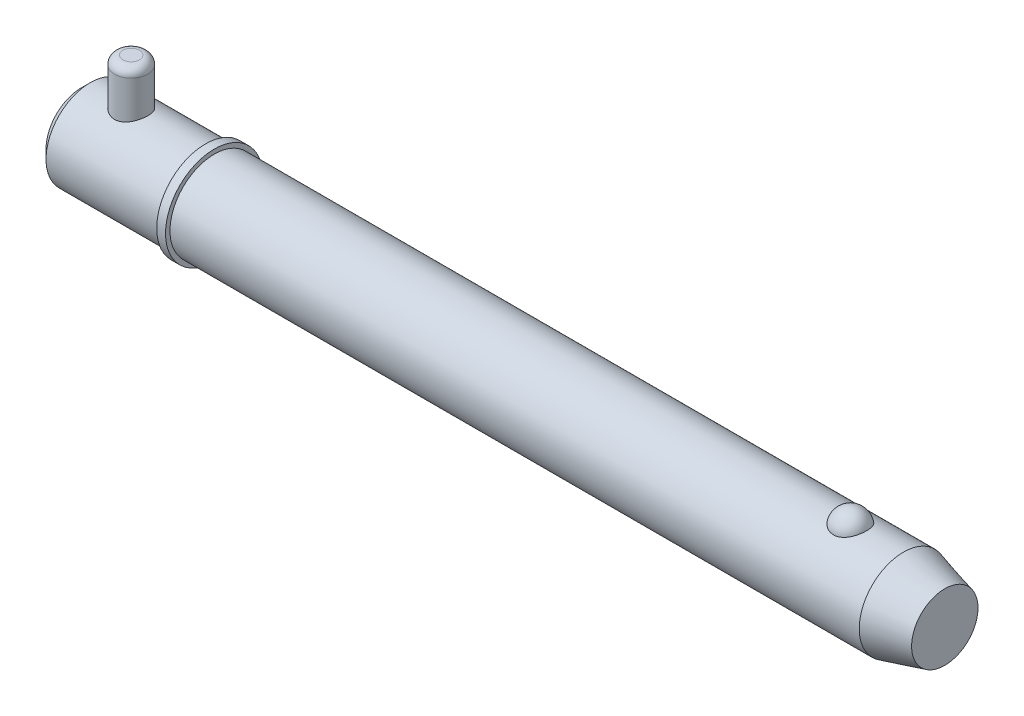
ISO-10303-21;
HEADER;
FILE_DESCRIPTION(('STEP AP214'),'2;1');
FILE_NAME('part.step','',(''),(''),'','','');
FILE_SCHEMA(('AUTOMOTIVE_DESIGN { 1 0 10303 214 1 1 1 1 }'));
ENDSEC;
DATA;
#1=APPLICATION_CONTEXT('core data for automotive mechanical design processes');
#2=APPLICATION_PROTOCOL_DEFINITION('international standard','automotive_design',2000,#1);
#3=PRODUCT_CONTEXT('',#1,'mechanical');
#4=PRODUCT('Part','Part','',(#3));
#5=PRODUCT_RELATED_PRODUCT_CATEGORY('part','',(#4));
#6=PRODUCT_DEFINITION_FORMATION('','',#4);
#7=PRODUCT_DEFINITION_CONTEXT('part definition',#1,'design');
#8=PRODUCT_DEFINITION('design','',#6,#7);
#9=PRODUCT_DEFINITION_SHAPE('','',#8);
#10=(LENGTH_UNIT() NAMED_UNIT(*) SI_UNIT(.MILLI.,.METRE.));
#11=(NAMED_UNIT(*) PLANE_ANGLE_UNIT() SI_UNIT($,.RADIAN.));
#12=(NAMED_UNIT(*) SI_UNIT($,.STERADIAN.) SOLID_ANGLE_UNIT());
#13=UNCERTAINTY_MEASURE_WITH_UNIT(LENGTH_MEASURE(1.E-05),#10,'distance_accuracy_value','');
#14=(GEOMETRIC_REPRESENTATION_CONTEXT(3) GLOBAL_UNCERTAINTY_ASSIGNED_CONTEXT((#13)) GLOBAL_UNIT_ASSIGNED_CONTEXT((#10,
#11,#12)) REPRESENTATION_CONTEXT('',''));
#15=CARTESIAN_POINT('',(0.,0.,0.));
#16=DIRECTION('',(0.,0.,1.));
#17=DIRECTION('',(1.,0.,0.));
#18=AXIS2_PLACEMENT_3D('',#15,#16,#17);
#19=CARTESIAN_POINT('',(14.28,25.4,0.));
#20=DIRECTION('',(0.,-1.,0.));
#21=DIRECTION('',(0.,0.,-1.));
#22=AXIS2_PLACEMENT_3D('',#19,#20,#21);
#23=CYLINDRICAL_SURFACE('',#22,4.76);
#24=CARTESIAN_POINT('',(14.28,-10.32,0.));
#25=DIRECTION('',(0.,1.,0.));
#26=DIRECTION('',(0.,0.,1.));
#27=AXIS2_PLACEMENT_3D('',#24,#25,#26);
#28=CIRCLE('',#27,4.76);
#29=CARTESIAN_POINT('',(14.28,-10.32,-4.76));
#30=VERTEX_POINT('',#29);
#31=EDGE_CURVE('P0_E25',#30,#30,#28,.T.);
#32=CARTESIAN_POINT('',(14.28,23.02,0.));
#33=DIRECTION('',(0.,1.,0.));
#34=DIRECTION('',(0.,0.,1.));
#35=AXIS2_PLACEMENT_3D('',#32,#33,#34);
#36=CIRCLE('',#35,4.76);
#37=CARTESIAN_POINT('',(14.28,23.02,-4.76));
#38=VERTEX_POINT('',#37);
#39=EDGE_CURVE('P0_E29',#38,#38,#36,.F.);
#40=CARTESIAN_POINT('',(14.28,-10.32,-4.76));
#41=CARTESIAN_POINT('',(14.28,-9.97270833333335,-4.76));
#42=CARTESIAN_POINT('',(14.28,-9.62541666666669,-4.76));
#43=CARTESIAN_POINT('',(14.28,-8.93083333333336,-4.76));
#44=CARTESIAN_POINT('',(14.28,-8.58354166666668,-4.76));
#45=CARTESIAN_POINT('',(14.28,-7.88895833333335,-4.76));
#46=CARTESIAN_POINT('',(14.28,-7.54166666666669,-4.76));
#47=CARTESIAN_POINT('',(14.28,-6.84708333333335,-4.76));
#48=CARTESIAN_POINT('',(14.28,-6.49979166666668,-4.76));
#49=CARTESIAN_POINT('',(14.28,-5.80520833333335,-4.76));
#50=CARTESIAN_POINT('',(14.28,-5.45791666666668,-4.76));
#51=CARTESIAN_POINT('',(14.28,-4.76333333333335,-4.76));
#52=CARTESIAN_POINT('',(14.28,-4.41604166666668,-4.76));
#53=CARTESIAN_POINT('',(14.28,-3.72145833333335,-4.76));
#54=CARTESIAN_POINT('',(14.28,-3.37416666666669,-4.76));
#55=CARTESIAN_POINT('',(14.28,-2.67958333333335,-4.76));
#56=CARTESIAN_POINT('',(14.28,-2.33229166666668,-4.76));
#57=CARTESIAN_POINT('',(14.28,-1.63770833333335,-4.76));
#58=CARTESIAN_POINT('',(14.28,-1.29041666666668,-4.76));
#59=CARTESIAN_POINT('',(14.28,-0.595833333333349,-4.76));
#60=CARTESIAN_POINT('',(14.28,-0.24854166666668,-4.76));
#61=CARTESIAN_POINT('',(14.28,0.446041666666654,-4.76));
#62=CARTESIAN_POINT('',(14.28,0.793333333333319,-4.76));
#63=CARTESIAN_POINT('',(14.28,1.48791666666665,-4.76));
#64=CARTESIAN_POINT('',(14.28,1.83520833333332,-4.76));
#65=CARTESIAN_POINT('',(14.28,2.52979166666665,-4.76));
#66=CARTESIAN_POINT('',(14.28,2.87708333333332,-4.76));
#67=CARTESIAN_POINT('',(14.28,3.57166666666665,-4.76));
#68=CARTESIAN_POINT('',(14.28,3.91895833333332,-4.76));
#69=CARTESIAN_POINT('',(14.28,4.61354166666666,-4.76));
#70=CARTESIAN_POINT('',(14.28,4.96083333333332,-4.76));
#71=CARTESIAN_POINT('',(14.28,5.65541666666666,-4.76));
#72=CARTESIAN_POINT('',(14.28,6.00270833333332,-4.76));
#73=CARTESIAN_POINT('',(14.28,6.69729166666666,-4.76));
#74=CARTESIAN_POINT('',(14.28,7.04458333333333,-4.76));
#75=CARTESIAN_POINT('',(14.28,7.73916666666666,-4.76));
#76=CARTESIAN_POINT('',(14.28,8.08645833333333,-4.76));
#77=CARTESIAN_POINT('',(14.28,8.78104166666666,-4.76));
#78=CARTESIAN_POINT('',(14.28,9.12833333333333,-4.76));
#79=CARTESIAN_POINT('',(14.28,9.82291666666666,-4.76));
#80=CARTESIAN_POINT('',(14.28,10.1702083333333,-4.76));
#81=CARTESIAN_POINT('',(14.28,10.8647916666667,-4.76));
#82=CARTESIAN_POINT('',(14.28,11.2120833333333,-4.76));
#83=CARTESIAN_POINT('',(14.28,11.9066666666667,-4.76));
#84=CARTESIAN_POINT('',(14.28,12.2539583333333,-4.76));
#85=CARTESIAN_POINT('',(14.28,12.9485416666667,-4.76));
#86=CARTESIAN_POINT('',(14.28,13.2958333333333,-4.76));
#87=CARTESIAN_POINT('',(14.28,13.9904166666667,-4.76));
#88=CARTESIAN_POINT('',(14.28,14.3377083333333,-4.76));
#89=CARTESIAN_POINT('',(14.28,15.0322916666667,-4.76));
#90=CARTESIAN_POINT('',(14.28,15.3795833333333,-4.76));
#91=CARTESIAN_POINT('',(14.28,16.0741666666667,-4.76));
#92=CARTESIAN_POINT('',(14.28,16.4214583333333,-4.76));
#93=CARTESIAN_POINT('',(14.28,17.1160416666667,-4.76));
#94=CARTESIAN_POINT('',(14.28,17.4633333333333,-4.76));
#95=CARTESIAN_POINT('',(14.28,18.1579166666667,-4.76));
#96=CARTESIAN_POINT('',(14.28,18.5052083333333,-4.76));
#97=CARTESIAN_POINT('',(14.28,19.1997916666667,-4.76));
#98=CARTESIAN_POINT('',(14.28,19.5470833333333,-4.76));
#99=CARTESIAN_POINT('',(14.28,20.2416666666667,-4.76));
#100=CARTESIAN_POINT('',(14.28,20.5889583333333,-4.76));
#101=CARTESIAN_POINT('',(14.28,21.2835416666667,-4.76));
#102=CARTESIAN_POINT('',(14.28,21.6308333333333,-4.76));
#103=CARTESIAN_POINT('',(14.28,22.3254166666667,-4.76));
#104=CARTESIAN_POINT('',(14.28,22.6727083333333,-4.76));
#105=CARTESIAN_POINT('',(14.28,23.02,-4.76));
#106=B_SPLINE_CURVE_WITH_KNOTS('',3,(#40,#41,#42,#43,#44,#45,#46,#47,#48,#49,#50,#51,#52,#53,
#54,#55,#56,#57,#58,#59,#60,#61,#62,#63,#64,#65,#66,#67,#68,#69,#70,#71,#72,#73,#74,#75,#76,#77,
#78,#79,#80,#81,#82,#83,#84,#85,#86,#87,#88,#89,#90,#91,#92,#93,#94,#95,#96,#97,#98,#99,#100,
#101,#102,#103,#104,#105),.UNSPECIFIED.,.F.,.F.,(4,2,2,2,2,2,2,2,2,2,2,2,2,2,2,2,2,2,2,2,2,2,2,
2,2,2,2,2,2,2,2,2,4),(0.,1.041875,2.08375,3.125625,4.1675,5.209375,6.25125,7.293125,
8.33500000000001,9.376875,10.41875,11.460625,12.5025,13.544375,14.58625,15.628125,16.67,
17.711875,18.75375,19.795625,20.8375,21.879375,22.92125,23.963125,25.005,26.046875,27.08875,
28.130625,29.1725,30.214375,31.25625,32.298125,33.34),.UNSPECIFIED.);
#107=EDGE_CURVE('P0_BSEAM14',#30,#38,#106,.T.);
#108=ORIENTED_EDGE('',*,*,#31,.T.);
#109=ORIENTED_EDGE('',*,*,#39,.T.);
#110=ORIENTED_EDGE('',*,*,#107,.T.);
#111=ORIENTED_EDGE('',*,*,#107,.F.);
#112=EDGE_LOOP('',(#108,#110,#109,#111));
#113=FACE_BOUND('',#112,.T.);
#114=ADVANCED_FACE('P0_F14',(#113),#23,.T.);
#115=CARTESIAN_POINT('',(14.28,25.4,0.));
#116=DIRECTION('',(0.,1.,0.));
#117=DIRECTION('',(0.,0.,1.));
#118=AXIS2_PLACEMENT_3D('',#115,#116,#117);
#119=PLANE('',#118);
#120=CARTESIAN_POINT('',(14.28,25.4,0.));
#121=DIRECTION('',(0.,1.,0.));
#122=DIRECTION('',(0.,0.,1.));
#123=AXIS2_PLACEMENT_3D('',#120,#121,#122);
#124=CIRCLE('',#123,2.38);
#125=CARTESIAN_POINT('',(14.28,25.4,2.38));
#126=VERTEX_POINT('',#125);
#127=EDGE_CURVE('P0_E10',#126,#126,#124,.T.);
#128=ORIENTED_EDGE('',*,*,#127,.T.);
#129=EDGE_LOOP('',(#128));
#130=FACE_BOUND('',#129,.T.);
#131=ADVANCED_FACE('P0_F46',(#130),#119,.T.);
#132=CARTESIAN_POINT('',(14.28,-12.7,0.));
#133=DIRECTION('',(0.,1.,0.));
#134=DIRECTION('',(0.,0.,1.));
#135=AXIS2_PLACEMENT_3D('',#132,#133,#134);
#136=PLANE('',#135);
#137=CARTESIAN_POINT('',(14.28,-12.7,0.));
#138=DIRECTION('',(0.,1.,0.));
#139=DIRECTION('',(0.,0.,1.));
#140=AXIS2_PLACEMENT_3D('',#137,#138,#139);
#141=CIRCLE('',#140,2.38);
#142=CARTESIAN_POINT('',(14.28,-12.7,2.38));
#143=VERTEX_POINT('',#142);
#144=EDGE_CURVE('P0_E21',#143,#143,#141,.F.);
#145=ORIENTED_EDGE('',*,*,#144,.T.);
#146=EDGE_LOOP('',(#145));
#147=FACE_BOUND('',#146,.T.);
#148=ADVANCED_FACE('P0_F43',(#147),#136,.F.);
#149=CARTESIAN_POINT('',(14.28,-10.32,0.));
#150=DIRECTION('',(0.,1.,0.));
#151=DIRECTION('',(0.,0.,1.));
#152=AXIS2_PLACEMENT_3D('',#149,#150,#151);
#153=DEGENERATE_TOROIDAL_SURFACE('',#152,2.38,2.38,.T.);
#154=ORIENTED_EDGE('',*,*,#144,.F.);
#155=EDGE_LOOP('',(#154));
#156=FACE_BOUND('',#155,.T.);
#157=ORIENTED_EDGE('',*,*,#31,.F.);
#158=EDGE_LOOP('',(#157));
#159=FACE_BOUND('',#158,.T.);
#160=ADVANCED_FACE('P0_F38',(#156,#159),#153,.T.);
#161=CARTESIAN_POINT('',(14.28,23.02,0.));
#162=DIRECTION('',(0.,1.,0.));
#163=DIRECTION('',(0.,0.,1.));
#164=AXIS2_PLACEMENT_3D('',#161,#162,#163);
#165=DEGENERATE_TOROIDAL_SURFACE('',#164,2.38,2.38,.T.);
#166=ORIENTED_EDGE('',*,*,#39,.F.);
#167=EDGE_LOOP('',(#166));
#168=FACE_BOUND('',#167,.T.);
#169=ORIENTED_EDGE('',*,*,#127,.F.);
#170=EDGE_LOOP('',(#169));
#171=FACE_BOUND('',#170,.T.);
#172=ADVANCED_FACE('P0_F16',(#168,#171),#165,.T.);
#173=CLOSED_SHELL('',(#114,#131,#148,#160,#172));
#174=MANIFOLD_SOLID_BREP('P0_B1',#173);
#175=CARTESIAN_POINT('',(0.,0.,0.));
#176=DIRECTION('',(1.,0.,0.));
#177=DIRECTION('',(0.,0.,-1.));
#178=AXIS2_PLACEMENT_3D('',#175,#176,#177);
#179=CYLINDRICAL_SURFACE('',#178,12.7);
#180=CARTESIAN_POINT('',(235.800738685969,0.,0.));
#181=DIRECTION('',(1.,0.,0.));
#182=DIRECTION('',(0.,0.,-1.));
#183=AXIS2_PLACEMENT_3D('',#180,#181,#182);
#184=CIRCLE('',#183,12.7);
#185=CARTESIAN_POINT('',(235.800738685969,0.,-12.7));
#186=VERTEX_POINT('',#185);
#187=EDGE_CURVE('P1_E81',#186,#186,#184,.T.);
#188=ORIENTED_EDGE('',*,*,#187,.F.);
#189=EDGE_LOOP('',(#188));
#190=FACE_BOUND('',#189,.T.);
#191=CARTESIAN_POINT('',(38.1,0.,0.));
#192=DIRECTION('',(1.,0.,0.));
#193=DIRECTION('',(0.,0.,-1.));
#194=AXIS2_PLACEMENT_3D('',#191,#192,#193);
#195=CIRCLE('',#194,12.7);
#196=CARTESIAN_POINT('',(38.1,0.,-12.7));
#197=VERTEX_POINT('',#196);
#198=EDGE_CURVE('P1_E85',#197,#197,#195,.T.);
#199=ORIENTED_EDGE('',*,*,#198,.T.);
#200=EDGE_LOOP('',(#199));
#201=FACE_BOUND('',#200,.T.);
#202=CARTESIAN_POINT('',(220.560042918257,11.7500437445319,4.81938502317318));
#203=CARTESIAN_POINT('',(220.435088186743,11.7500430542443,4.81938571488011));
#204=CARTESIAN_POINT('',(220.310144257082,11.7520975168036,4.81438658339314));
#205=CARTESIAN_POINT('',(220.061142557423,11.760253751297,4.79442904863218));
#206=CARTESIAN_POINT('',(219.937085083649,11.7663568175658,4.77946746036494));
#207=CARTESIAN_POINT('',(219.690901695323,11.7824262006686,4.73971414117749));
#208=CARTESIAN_POINT('',(219.568774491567,11.7923898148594,4.71492928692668));
#209=CARTESIAN_POINT('',(219.327187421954,11.8158938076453,4.65571340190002));
#210=CARTESIAN_POINT('',(219.20772859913,11.8294355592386,4.6212786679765));
#211=CARTESIAN_POINT('',(218.972557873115,11.8596812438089,4.54309502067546));
#212=CARTESIAN_POINT('',(218.856839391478,11.8763792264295,4.49936361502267));
#213=CARTESIAN_POINT('',(218.629653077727,11.9124878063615,4.40287235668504));
#214=CARTESIAN_POINT('',(218.518186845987,11.9318994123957,4.35010914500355));
#215=CARTESIAN_POINT('',(218.191278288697,11.9934256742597,4.17881316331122));
#216=CARTESIAN_POINT('',(217.983127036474,12.038858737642,4.04720756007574));
#217=CARTESIAN_POINT('',(217.585850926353,12.1352173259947,3.748564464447));
#218=CARTESIAN_POINT('',(217.397443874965,12.1862630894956,3.58061821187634));
#219=CARTESIAN_POINT('',(217.050521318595,12.2875163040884,3.21600758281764));
#220=CARTESIAN_POINT('',(216.892011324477,12.3377235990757,3.0193379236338));
#221=CARTESIAN_POINT('',(216.60168878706,12.4344923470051,2.592916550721));
#222=CARTESIAN_POINT('',(216.471376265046,12.4807925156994,2.36208286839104));
#223=CARTESIAN_POINT('',(216.249407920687,12.5623454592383,1.88070399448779));
#224=CARTESIAN_POINT('',(216.157755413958,12.5975972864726,1.63015711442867));
#225=CARTESIAN_POINT('',(216.014046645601,12.6538414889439,1.1129886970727));
#226=CARTESIAN_POINT('',(215.962499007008,12.6746503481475,0.846205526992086));
#227=CARTESIAN_POINT('',(215.901977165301,12.699153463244,0.307085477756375));
#228=CARTESIAN_POINT('',(215.893001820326,12.7028481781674,0.034748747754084));
#229=CARTESIAN_POINT('',(215.917731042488,12.6927785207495,-0.506073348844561));
#230=CARTESIAN_POINT('',(215.951189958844,12.6791146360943,-0.774571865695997));
#231=CARTESIAN_POINT('',(216.059687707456,12.635882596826,-1.30170246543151));
#232=CARTESIAN_POINT('',(216.13472729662,12.606314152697,-1.56033436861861));
#233=CARTESIAN_POINT('',(216.32500006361,12.5342328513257,-2.0608389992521));
#234=CARTESIAN_POINT('',(216.440287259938,12.4917026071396,-2.30268867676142));
#235=CARTESIAN_POINT('',(216.708704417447,12.3981123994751,-2.76259600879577));
#236=CARTESIAN_POINT('',(216.861837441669,12.3470517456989,-2.98065173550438));
#237=CARTESIAN_POINT('',(217.203507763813,12.2416045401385,-3.38786328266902));
#238=CARTESIAN_POINT('',(217.392201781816,12.1872040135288,-3.57688418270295));
#239=CARTESIAN_POINT('',(217.800239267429,12.0814086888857,-3.91941073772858));
#240=CARTESIAN_POINT('',(218.019580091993,12.0300136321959,-4.07291945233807));
#241=CARTESIAN_POINT('',(218.478375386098,11.9373542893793,-4.33691289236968));
#242=CARTESIAN_POINT('',(218.717304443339,11.8958982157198,-4.44824125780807));
#243=CARTESIAN_POINT('',(219.21243761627,11.8268116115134,-4.62881985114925));
#244=CARTESIAN_POINT('',(219.468635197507,11.7991758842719,-4.69808589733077));
#245=CARTESIAN_POINT('',(219.977164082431,11.7622209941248,-4.78983181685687));
#246=CARTESIAN_POINT('',(220.229041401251,11.7520502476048,-4.81449025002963));
#247=CARTESIAN_POINT('',(220.733573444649,11.7485796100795,-4.82295735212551));
#248=CARTESIAN_POINT('',(220.986228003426,11.7552763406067,-4.80677420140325));
#249=CARTESIAN_POINT('',(221.476834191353,11.7842584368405,-4.73525430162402));
#250=CARTESIAN_POINT('',(221.714998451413,11.8060486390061,-4.68116061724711));
#251=CARTESIAN_POINT('',(222.178489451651,11.8622750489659,-4.53678133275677));
#252=CARTESIAN_POINT('',(222.403815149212,11.8967122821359,-4.44649279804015));
#253=CARTESIAN_POINT('',(222.840801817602,11.9754603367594,-4.22987613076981));
#254=CARTESIAN_POINT('',(223.052057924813,12.0199699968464,-4.10280539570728));
#255=CARTESIAN_POINT('',(223.450601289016,12.1138028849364,-3.81685409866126));
#256=CARTESIAN_POINT('',(223.637883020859,12.163127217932,-3.65796622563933));
#257=CARTESIAN_POINT('',(223.993350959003,12.2642343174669,-3.30364864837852));
#258=CARTESIAN_POINT('',(224.160111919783,12.3160165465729,-3.10678783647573));
#259=CARTESIAN_POINT('',(224.459579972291,12.4142566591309,-2.68748409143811));
#260=CARTESIAN_POINT('',(224.592280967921,12.4607135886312,-2.4650365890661));
#261=CARTESIAN_POINT('',(224.824691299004,12.5450236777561,-1.9928951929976));
#262=CARTESIAN_POINT('',(224.923215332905,12.5825557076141,-1.74255918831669));
#263=CARTESIAN_POINT('',(225.079227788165,12.6431720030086,-1.22773734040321));
#264=CARTESIAN_POINT('',(225.136715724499,12.6662560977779,-0.963251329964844));
#265=CARTESIAN_POINT('',(225.209544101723,12.6956486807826,-0.427355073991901));
#266=CARTESIAN_POINT('',(225.224837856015,12.7019385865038,-0.155937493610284));
#267=CARTESIAN_POINT('',(225.212779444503,12.6970201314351,0.385928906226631));
#268=CARTESIAN_POINT('',(225.18542805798,12.6858120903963,0.656377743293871));
#269=CARTESIAN_POINT('',(225.113060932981,12.6568455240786,1.05454017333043));
#270=CARTESIAN_POINT('',(225.083796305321,12.6451962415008,1.185778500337));
#271=CARTESIAN_POINT('',(225.015022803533,12.6181819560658,1.44513808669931));
#272=CARTESIAN_POINT('',(224.975517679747,12.6028183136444,1.57326046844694));
#273=CARTESIAN_POINT('',(224.886439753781,12.5687547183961,1.82554978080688));
#274=CARTESIAN_POINT('',(224.836862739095,12.5500533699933,1.94971503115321));
#275=CARTESIAN_POINT('',(224.72792115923,12.5098093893,2.19314370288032));
#276=CARTESIAN_POINT('',(224.668560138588,12.4882677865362,2.31240887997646));
#277=CARTESIAN_POINT('',(224.53997128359,12.4427679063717,2.5459303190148));
#278=CARTESIAN_POINT('',(224.470688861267,12.4187964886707,2.66015396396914));
#279=CARTESIAN_POINT('',(224.322903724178,12.3691892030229,2.882026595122));
#280=CARTESIAN_POINT('',(224.244404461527,12.3435539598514,2.98967802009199));
#281=CARTESIAN_POINT('',(224.078550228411,12.2912955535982,3.1977438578));
#282=CARTESIAN_POINT('',(223.991191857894,12.2646720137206,3.298155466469));
#283=CARTESIAN_POINT('',(223.808161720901,12.2111945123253,3.49095035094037));
#284=CARTESIAN_POINT('',(223.712493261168,12.1843406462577,3.58333679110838));
#285=CARTESIAN_POINT('',(223.513627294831,12.1312249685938,3.75922876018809));
#286=CARTESIAN_POINT('',(223.410450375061,12.104961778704,3.84275713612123));
#287=CARTESIAN_POINT('',(223.19701336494,12.0537284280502,4.00056406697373));
#288=CARTESIAN_POINT('',(223.086756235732,12.028757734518,4.07484645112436));
#289=CARTESIAN_POINT('',(222.859755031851,11.9808306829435,4.21367959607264));
#290=CARTESIAN_POINT('',(222.743006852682,11.9578756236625,4.27822410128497));
#291=CARTESIAN_POINT('',(222.50394258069,11.9147184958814,4.39698483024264));
#292=CARTESIAN_POINT('',(222.381628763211,11.894515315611,4.45120522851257));
#293=CARTESIAN_POINT('',(222.122952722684,11.8561129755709,4.55255353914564));
#294=CARTESIAN_POINT('',(221.986223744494,11.8381764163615,4.59884858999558));
#295=CARTESIAN_POINT('',(221.708608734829,11.8069093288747,4.67853897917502));
#296=CARTESIAN_POINT('',(221.567724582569,11.7935767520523,4.71194005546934));
#297=CARTESIAN_POINT('',(221.28309446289,11.7720277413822,4.76552188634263));
#298=CARTESIAN_POINT('',(221.139348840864,11.7638106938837,4.78570422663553));
#299=CARTESIAN_POINT('',(220.850411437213,11.7528195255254,4.81263433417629));
#300=CARTESIAN_POINT('',(220.705219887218,11.7500445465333,4.81938421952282));
#301=CARTESIAN_POINT('',(220.560042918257,11.7500437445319,4.81938502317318));
#302=B_SPLINE_CURVE_WITH_KNOTS('',3,(#202,#203,#204,#205,#206,#207,#208,#209,#210,#211,#212,
#213,#214,#215,#216,#217,#218,#219,#220,#221,#222,#223,#224,#225,#226,#227,#228,#229,#230,#231,
#232,#233,#234,#235,#236,#237,#238,#239,#240,#241,#242,#243,#244,#245,#246,#247,#248,#249,#250,
#251,#252,#253,#254,#255,#256,#257,#258,#259,#260,#261,#262,#263,#264,#265,#266,#267,#268,#269,
#270,#271,#272,#273,#274,#275,#276,#277,#278,#279,#280,#281,#282,#283,#284,#285,#286,#287,#288,
#289,#290,#291,#292,#293,#294,#295,#296,#297,#298,#299,#300,#301),.UNSPECIFIED.,.T.,.F.,(4,2,2,
2,2,2,2,2,2,2,2,2,2,2,2,2,2,2,2,2,2,2,2,2,2,2,2,2,2,2,2,2,2,2,2,2,2,2,2,2,2,2,2,2,2,2,2,2,2,4),
(0.,0.374729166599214,0.749578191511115,1.12416526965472,1.49889629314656,1.87292776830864,
2.24709865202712,2.99481328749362,3.76399449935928,4.53331735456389,5.3368391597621,
6.14042986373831,6.95405296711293,7.76765424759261,8.57656703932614,9.38549455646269,
10.1955119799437,11.0055949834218,11.8193353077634,12.6330054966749,13.4294141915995,
14.2255231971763,14.9815786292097,15.7374826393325,16.4696948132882,17.2019663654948,
17.9501979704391,18.6986017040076,19.4844704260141,20.2704797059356,21.0815215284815,
21.8925729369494,22.7045213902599,23.5164550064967,23.9209608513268,24.3253187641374,
24.7298461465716,25.1342272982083,25.5409255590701,25.9474719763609,26.3541750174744,
26.7607169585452,27.1661834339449,27.5714814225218,27.9770386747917,28.3824315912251,
28.8181206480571,29.2536155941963,29.6890582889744,30.1244323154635),.UNSPECIFIED.);
#303=CARTESIAN_POINT('',(220.560042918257,11.7500437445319,4.81938502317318));
#304=VERTEX_POINT('',#303);
#305=EDGE_CURVE('P1_E35',#304,#304,#302,.T.);
#306=ORIENTED_EDGE('',*,*,#305,.T.);
#307=EDGE_LOOP('',(#306));
#308=FACE_BOUND('',#307,.T.);
#309=ADVANCED_FACE('P1_F13',(#190,#201,#308),#179,.T.);
#310=CARTESIAN_POINT('',(0.,0.,0.));
#311=DIRECTION('',(-1.,0.,0.));
#312=DIRECTION('',(0.,0.,1.));
#313=AXIS2_PLACEMENT_3D('',#310,#311,#312);
#314=PLANE('',#313);
#315=CARTESIAN_POINT('',(0.,0.,0.));
#316=DIRECTION('',(1.,0.,0.));
#317=DIRECTION('',(0.,0.,-1.));
#318=AXIS2_PLACEMENT_3D('',#315,#316,#317);
#319=CIRCLE('',#318,10.16);
#320=CARTESIAN_POINT('',(0.,0.,-10.16));
#321=VERTEX_POINT('',#320);
#322=EDGE_CURVE('P1_E9',#321,#321,#319,.T.);
#323=ORIENTED_EDGE('',*,*,#322,.F.);
#324=EDGE_LOOP('',(#323));
#325=FACE_BOUND('',#324,.T.);
#326=ADVANCED_FACE('P1_F15',(#325),#314,.T.);
#327=CARTESIAN_POINT('',(2.53999999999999,0.,0.));
#328=DIRECTION('',(1.,0.,0.));
#329=DIRECTION('',(0.,0.,-1.));
#330=AXIS2_PLACEMENT_3D('',#327,#328,#329);
#331=CONICAL_SURFACE('',#330,12.7,0.78539816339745);
#332=ORIENTED_EDGE('',*,*,#322,.T.);
#333=EDGE_LOOP('',(#332));
#334=FACE_BOUND('',#333,.T.);
#335=CARTESIAN_POINT('',(2.53999999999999,0.,0.));
#336=DIRECTION('',(1.,0.,0.));
#337=DIRECTION('',(0.,0.,-1.));
#338=AXIS2_PLACEMENT_3D('',#335,#336,#337);
#339=CIRCLE('',#338,12.7);
#340=CARTESIAN_POINT('',(2.53999999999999,0.,-12.7));
#341=VERTEX_POINT('',#340);
#342=EDGE_CURVE('P1_E26',#341,#341,#339,.T.);
#343=ORIENTED_EDGE('',*,*,#342,.F.);
#344=EDGE_LOOP('',(#343));
#345=FACE_BOUND('',#344,.T.);
#346=ADVANCED_FACE('P1_F77',(#334,#345),#331,.T.);
#347=CARTESIAN_POINT('',(0.,0.,0.));
#348=DIRECTION('',(1.,0.,0.));
#349=DIRECTION('',(0.,0.,-1.));
#350=AXIS2_PLACEMENT_3D('',#347,#348,#349);
#351=CYLINDRICAL_SURFACE('',#350,12.7);
#352=CARTESIAN_POINT('',(14.28,-11.7742260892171,4.76));
#353=CARTESIAN_POINT('',(14.1514948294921,-11.7742255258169,4.76000061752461));
#354=CARTESIAN_POINT('',(14.0229980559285,-11.7763355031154,4.75479194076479));
#355=CARTESIAN_POINT('',(13.7669369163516,-11.7847043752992,4.73401198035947));
#356=CARTESIAN_POINT('',(13.6393728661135,-11.7909646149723,4.71843733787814));
#357=CARTESIAN_POINT('',(13.386226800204,-11.8074248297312,4.67709434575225));
#358=CARTESIAN_POINT('',(13.2606439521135,-11.8176231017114,4.65133040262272));
#359=CARTESIAN_POINT('',(13.0122434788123,-11.8416347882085,4.58985545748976));
#360=CARTESIAN_POINT('',(12.8894269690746,-11.8554496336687,4.55414051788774));
#361=CARTESIAN_POINT('',(12.6477622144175,-11.8862222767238,4.47320764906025));
#362=CARTESIAN_POINT('',(12.5289037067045,-11.9031710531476,4.4280169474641));
#363=CARTESIAN_POINT('',(12.2955059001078,-11.939736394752,4.32845291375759));
#364=CARTESIAN_POINT('',(12.1809682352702,-11.9593539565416,4.2740761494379));
#365=CARTESIAN_POINT('',(11.8448901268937,-12.0213893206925,4.09777237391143));
#366=CARTESIAN_POINT('',(11.6307077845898,-12.0670135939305,3.9626122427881));
#367=CARTESIAN_POINT('',(11.2179129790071,-12.1641514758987,3.65386230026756));
#368=CARTESIAN_POINT('',(11.0204399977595,-12.2158379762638,3.47881300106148));
#369=CARTESIAN_POINT('',(10.6568212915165,-12.3178468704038,3.09829182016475));
#370=CARTESIAN_POINT('',(10.4906822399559,-12.3681689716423,2.89281347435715));
#371=CARTESIAN_POINT('',(10.1890299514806,-12.4638367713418,2.44867909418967));
#372=CARTESIAN_POINT('',(10.054749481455,-12.5089552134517,2.20913281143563));
#373=CARTESIAN_POINT('',(9.82886079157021,-12.5870472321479,1.70885919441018));
#374=CARTESIAN_POINT('',(9.73723778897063,-12.620025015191,1.44813923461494));
#375=CARTESIAN_POINT('',(9.60324488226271,-12.6688874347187,0.9248423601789));
#376=CARTESIAN_POINT('',(9.55892269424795,-12.6854474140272,0.662829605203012));
#377=CARTESIAN_POINT('',(9.5145335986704,-12.7020320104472,0.134596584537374));
#378=CARTESIAN_POINT('',(9.5144523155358,-12.7020619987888,-0.131622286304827));
#379=CARTESIAN_POINT('',(9.55741019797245,-12.6860129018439,-0.646717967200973));
#380=CARTESIAN_POINT('',(9.59831845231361,-12.6707298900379,-0.895801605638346));
#381=CARTESIAN_POINT('',(9.71850987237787,-12.6268158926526,-1.38327219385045));
#382=CARTESIAN_POINT('',(9.79779575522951,-12.5981839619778,-1.62165838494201));
#383=CARTESIAN_POINT('',(9.99348296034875,-12.5298894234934,-2.08508424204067));
#384=CARTESIAN_POINT('',(10.110407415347,-12.4900724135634,-2.30987931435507));
#385=CARTESIAN_POINT('',(10.3775896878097,-12.4034373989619,-2.7372158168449));
#386=CARTESIAN_POINT('',(10.5278582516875,-12.3566171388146,-2.93975004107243));
#387=CARTESIAN_POINT('',(10.8677318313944,-12.257571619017,-3.32936830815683));
#388=CARTESIAN_POINT('',(11.0591227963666,-12.2051903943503,-3.51485714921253));
#389=CARTESIAN_POINT('',(11.4706087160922,-12.1031155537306,-3.85170663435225));
#390=CARTESIAN_POINT('',(11.6907108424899,-12.0534226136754,-4.00305872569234));
#391=CARTESIAN_POINT('',(12.1596597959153,-11.9613684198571,-4.27038218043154));
#392=CARTESIAN_POINT('',(12.4090353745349,-11.9191939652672,-4.38549550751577));
#393=CARTESIAN_POINT('',(12.9256290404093,-11.8491124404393,-4.57149117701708));
#394=CARTESIAN_POINT('',(13.1928371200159,-11.8211974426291,-4.64239810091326));
#395=CARTESIAN_POINT('',(13.7217488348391,-11.7846654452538,-4.73434137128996));
#396=CARTESIAN_POINT('',(13.9829438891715,-11.7750694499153,-4.75791141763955));
#397=CARTESIAN_POINT('',(14.5056760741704,-11.7734909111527,-4.76182097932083));
#398=CARTESIAN_POINT('',(14.7672131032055,-11.7815039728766,-4.74217128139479));
#399=CARTESIAN_POINT('',(15.2702140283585,-11.8132466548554,-4.66249544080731));
#400=CARTESIAN_POINT('',(15.5120417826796,-11.8362133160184,-4.60442726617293));
#401=CARTESIAN_POINT('',(15.9824097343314,-11.8943704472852,-4.45202868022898));
#402=CARTESIAN_POINT('',(16.2109472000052,-11.9295634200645,-4.35769084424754));
#403=CARTESIAN_POINT('',(16.6577741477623,-12.0098310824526,-4.13144368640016));
#404=CARTESIAN_POINT('',(16.8753590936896,-12.055226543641,-3.99825937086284));
#405=CARTESIAN_POINT('',(17.2859732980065,-12.150238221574,-3.69949845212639));
#406=CARTESIAN_POINT('',(17.4789935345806,-12.19985597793,-3.5339100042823));
#407=CARTESIAN_POINT('',(17.8477707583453,-12.3015434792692,-3.1624728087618));
#408=CARTESIAN_POINT('',(18.0216609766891,-12.3535695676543,-2.95473880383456));
#409=CARTESIAN_POINT('',(18.254545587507,-12.426745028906,-2.62277433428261));
#410=CARTESIAN_POINT('',(18.3275489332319,-12.4503382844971,-2.50865480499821));
#411=CARTESIAN_POINT('',(18.463723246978,-12.4952713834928,-2.27428971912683));
#412=CARTESIAN_POINT('',(18.5268984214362,-12.5166121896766,-2.15404681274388));
#413=CARTESIAN_POINT('',(18.6427140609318,-12.5563817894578,-1.90858448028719));
#414=CARTESIAN_POINT('',(18.6953855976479,-12.5748191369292,-1.78338108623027));
#415=CARTESIAN_POINT('',(18.7899337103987,-12.6083284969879,-1.52857834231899));
#416=CARTESIAN_POINT('',(18.8318147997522,-12.6234019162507,-1.39898085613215));
#417=CARTESIAN_POINT('',(18.9043819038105,-12.6497495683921,-1.13633254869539));
#418=CARTESIAN_POINT('',(18.9350698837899,-12.6610244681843,-1.00328233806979));
#419=CARTESIAN_POINT('',(18.9849303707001,-12.6794412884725,-0.734761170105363));
#420=CARTESIAN_POINT('',(19.0041035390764,-12.6865834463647,-0.59929035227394));
#421=CARTESIAN_POINT('',(19.0299427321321,-12.6962286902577,-0.335006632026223));
#422=CARTESIAN_POINT('',(19.0372742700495,-12.698978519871,-0.206267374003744));
#423=CARTESIAN_POINT('',(19.0414668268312,-12.7005496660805,0.0514515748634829));
#424=CARTESIAN_POINT('',(19.038324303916,-12.69936965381,0.180431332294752));
#425=CARTESIAN_POINT('',(19.0215965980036,-12.6931114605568,0.437551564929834));
#426=CARTESIAN_POINT('',(19.0080165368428,-12.6880351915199,0.565692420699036));
#427=CARTESIAN_POINT('',(18.9705519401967,-12.6741222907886,0.820297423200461));
#428=CARTESIAN_POINT('',(18.9466635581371,-12.665284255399,0.946760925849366));
#429=CARTESIAN_POINT('',(18.8895279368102,-12.6443449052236,1.19395899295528));
#430=CARTESIAN_POINT('',(18.8565273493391,-12.6323299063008,1.3147578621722));
#431=CARTESIAN_POINT('',(18.781239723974,-12.6052503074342,1.55308888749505));
#432=CARTESIAN_POINT('',(18.738949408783,-12.5901846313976,1.67061987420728));
#433=CARTESIAN_POINT('',(18.5986461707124,-12.5409473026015,2.01714406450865));
#434=CARTESIAN_POINT('',(18.4871532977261,-12.502717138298,2.24027279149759));
#435=CARTESIAN_POINT('',(18.2262440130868,-12.4173042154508,2.6742599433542));
#436=CARTESIAN_POINT('',(18.0754310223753,-12.3698127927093,2.88420891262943));
#437=CARTESIAN_POINT('',(17.7421836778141,-12.271667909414,3.27675114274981));
#438=CARTESIAN_POINT('',(17.5597380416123,-12.2210133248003,3.45933459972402));
#439=CARTESIAN_POINT('',(17.2605468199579,-12.1452079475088,3.7138066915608));
#440=CARTESIAN_POINT('',(17.1535518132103,-12.119328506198,3.79719993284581));
#441=CARTESIAN_POINT('',(16.9326449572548,-12.0688597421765,3.95467398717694));
#442=CARTESIAN_POINT('',(16.8187356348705,-12.0442699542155,4.02875817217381));
#443=CARTESIAN_POINT('',(16.5846234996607,-11.9971053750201,4.16711104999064));
#444=CARTESIAN_POINT('',(16.4644172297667,-11.9745317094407,4.23137427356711));
#445=CARTESIAN_POINT('',(16.2185866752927,-11.9321360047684,4.34949041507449));
#446=CARTESIAN_POINT('',(16.09296473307,-11.9123127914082,4.40334777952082));
#447=CARTESIAN_POINT('',(15.8314769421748,-11.875268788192,4.50232278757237));
#448=CARTESIAN_POINT('',(15.6954035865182,-11.8582009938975,4.54695127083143));
#449=CARTESIAN_POINT('',(15.4194002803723,-11.8284328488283,4.62383807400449));
#450=CARTESIAN_POINT('',(15.2794720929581,-11.815730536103,4.6561019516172));
#451=CARTESIAN_POINT('',(14.9969657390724,-11.7951940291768,4.70788444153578));
#452=CARTESIAN_POINT('',(14.8543884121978,-11.7873583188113,4.72740702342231));
#453=CARTESIAN_POINT('',(14.5678704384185,-11.7768749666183,4.75346370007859));
#454=CARTESIAN_POINT('',(14.4239299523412,-11.7742267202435,4.75999930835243));
#455=CARTESIAN_POINT('',(14.28,-11.7742260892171,4.76));
#456=B_SPLINE_CURVE_WITH_KNOTS('',3,(#352,#353,#354,#355,#356,#357,#358,#359,#360,#361,#362,
#363,#364,#365,#366,#367,#368,#369,#370,#371,#372,#373,#374,#375,#376,#377,#378,#379,#380,#381,
#382,#383,#384,#385,#386,#387,#388,#389,#390,#391,#392,#393,#394,#395,#396,#397,#398,#399,#400,
#401,#402,#403,#404,#405,#406,#407,#408,#409,#410,#411,#412,#413,#414,#415,#416,#417,#418,#419,
#420,#421,#422,#423,#424,#425,#426,#427,#428,#429,#430,#431,#432,#433,#434,#435,#436,#437,#438,
#439,#440,#441,#442,#443,#444,#445,#446,#447,#448,#449,#450,#451,#452,#453,#454,#455),
.UNSPECIFIED.,.T.,.F.,(4,2,2,2,2,2,2,2,2,2,2,2,2,2,2,2,2,2,2,2,2,2,2,2,2,2,2,2,2,2,2,2,2,2,2,2,
2,2,2,2,2,2,2,2,2,2,2,2,2,2,2,4),(0.,0.385378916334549,0.770882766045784,1.15622008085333,
1.54171009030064,1.92610725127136,2.31064835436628,3.07917291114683,3.88239385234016,
4.68578566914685,5.51648193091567,6.34689010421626,7.14151420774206,7.93588010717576,
8.69098665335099,9.44614666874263,10.2122918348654,10.9786842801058,11.789876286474,
12.6012713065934,13.4306405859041,14.2595482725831,15.0427613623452,15.8257790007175,
16.5716820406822,17.3177378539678,18.0917395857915,18.8660247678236,19.6893332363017,
20.1014571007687,20.5134040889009,20.9241137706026,21.3346513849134,21.7451168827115,
22.1555587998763,22.542011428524,22.928594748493,23.3149884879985,23.7015265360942,
24.0784835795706,24.4555738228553,25.2091300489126,25.994347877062,26.7798463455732,
27.1937428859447,27.6074890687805,28.0214648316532,28.4352633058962,28.8672794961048,
29.299101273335,29.7307884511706,30.1624253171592),.UNSPECIFIED.);
#457=CARTESIAN_POINT('',(14.28,-11.7742260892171,4.76));
#458=VERTEX_POINT('',#457);
#459=EDGE_CURVE('P1_E17',#458,#458,#456,.T.);
#460=ORIENTED_EDGE('',*,*,#459,.F.);
#461=EDGE_LOOP('',(#460));
#462=FACE_BOUND('',#461,.T.);
#463=CARTESIAN_POINT('',(14.28,11.7742260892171,4.76));
#464=CARTESIAN_POINT('',(14.4085051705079,11.7742255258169,4.76000061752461));
#465=CARTESIAN_POINT('',(14.5370019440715,11.7763355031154,4.75479194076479));
#466=CARTESIAN_POINT('',(14.7930630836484,11.7847043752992,4.73401198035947));
#467=CARTESIAN_POINT('',(14.9206271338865,11.7909646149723,4.71843733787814));
#468=CARTESIAN_POINT('',(15.173773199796,11.8074248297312,4.67709434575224));
#469=CARTESIAN_POINT('',(15.2993560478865,11.8176231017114,4.65133040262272));
#470=CARTESIAN_POINT('',(15.5477565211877,11.8416347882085,4.58985545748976));
#471=CARTESIAN_POINT('',(15.6705730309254,11.8554496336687,4.55414051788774));
#472=CARTESIAN_POINT('',(15.9122377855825,11.8862222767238,4.47320764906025));
#473=CARTESIAN_POINT('',(16.0310962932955,11.9031710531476,4.4280169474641));
#474=CARTESIAN_POINT('',(16.2644940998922,11.939736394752,4.32845291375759));
#475=CARTESIAN_POINT('',(16.3790317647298,11.9593539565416,4.2740761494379));
#476=CARTESIAN_POINT('',(16.7151098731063,12.0213893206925,4.09777237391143));
#477=CARTESIAN_POINT('',(16.9292922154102,12.0670135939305,3.96261224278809));
#478=CARTESIAN_POINT('',(17.3420870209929,12.1641514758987,3.65386230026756));
#479=CARTESIAN_POINT('',(17.5395600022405,12.2158379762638,3.47881300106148));
#480=CARTESIAN_POINT('',(17.9031787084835,12.3178468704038,3.09829182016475));
#481=CARTESIAN_POINT('',(18.0693177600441,12.3681689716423,2.89281347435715));
#482=CARTESIAN_POINT('',(18.3709700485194,12.4638367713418,2.44867909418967));
#483=CARTESIAN_POINT('',(18.505250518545,12.5089552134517,2.20913281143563));
#484=CARTESIAN_POINT('',(18.7311392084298,12.5870472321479,1.70885919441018));
#485=CARTESIAN_POINT('',(18.8227622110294,12.620025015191,1.44813923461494));
#486=CARTESIAN_POINT('',(18.9567551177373,12.6688874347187,0.924842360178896));
#487=CARTESIAN_POINT('',(19.0010773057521,12.6854474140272,0.662829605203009));
#488=CARTESIAN_POINT('',(19.0454664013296,12.7020320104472,0.134596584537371));
#489=CARTESIAN_POINT('',(19.0455476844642,12.7020619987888,-0.13162228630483));
#490=CARTESIAN_POINT('',(19.0025898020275,12.6860129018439,-0.646717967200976));
#491=CARTESIAN_POINT('',(18.9616815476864,12.6707298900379,-0.89580160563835));
#492=CARTESIAN_POINT('',(18.8414901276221,12.6268158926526,-1.38327219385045));
#493=CARTESIAN_POINT('',(18.7622042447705,12.5981839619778,-1.62165838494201));
#494=CARTESIAN_POINT('',(18.5665170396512,12.5298894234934,-2.08508424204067));
#495=CARTESIAN_POINT('',(18.449592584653,12.4900724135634,-2.30987931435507));
#496=CARTESIAN_POINT('',(18.1824103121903,12.4034373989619,-2.7372158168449));
#497=CARTESIAN_POINT('',(18.0321417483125,12.3566171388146,-2.93975004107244));
#498=CARTESIAN_POINT('',(17.6922681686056,12.257571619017,-3.32936830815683));
#499=CARTESIAN_POINT('',(17.5008772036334,12.2051903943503,-3.51485714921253));
#500=CARTESIAN_POINT('',(17.0893912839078,12.1031155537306,-3.85170663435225));
#501=CARTESIAN_POINT('',(16.8692891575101,12.0534226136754,-4.00305872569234));
#502=CARTESIAN_POINT('',(16.4003402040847,11.9613684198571,-4.27038218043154));
#503=CARTESIAN_POINT('',(16.1509646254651,11.9191939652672,-4.38549550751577));
#504=CARTESIAN_POINT('',(15.6343709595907,11.8491124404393,-4.57149117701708));
#505=CARTESIAN_POINT('',(15.367162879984,11.8211974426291,-4.64239810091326));
#506=CARTESIAN_POINT('',(14.8382511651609,11.7846654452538,-4.73434137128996));
#507=CARTESIAN_POINT('',(14.5770561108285,11.7750694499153,-4.75791141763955));
#508=CARTESIAN_POINT('',(14.0543239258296,11.7734909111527,-4.76182097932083));
#509=CARTESIAN_POINT('',(13.7927868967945,11.7815039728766,-4.74217128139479));
#510=CARTESIAN_POINT('',(13.2897859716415,11.8132466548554,-4.66249544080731));
#511=CARTESIAN_POINT('',(13.0479582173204,11.8362133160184,-4.60442726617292));
#512=CARTESIAN_POINT('',(12.5775902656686,11.8943704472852,-4.45202868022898));
#513=CARTESIAN_POINT('',(12.3490527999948,11.9295634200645,-4.35769084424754));
#514=CARTESIAN_POINT('',(11.9022258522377,12.0098310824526,-4.13144368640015));
#515=CARTESIAN_POINT('',(11.6846409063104,12.055226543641,-3.99825937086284));
#516=CARTESIAN_POINT('',(11.2740267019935,12.150238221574,-3.69949845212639));
#517=CARTESIAN_POINT('',(11.0810064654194,12.19985597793,-3.5339100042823));
#518=CARTESIAN_POINT('',(10.7122292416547,12.3015434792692,-3.1624728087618));
#519=CARTESIAN_POINT('',(10.5383390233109,12.3535695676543,-2.95473880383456));
#520=CARTESIAN_POINT('',(10.305454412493,12.426745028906,-2.6227743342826));
#521=CARTESIAN_POINT('',(10.2324510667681,12.4503382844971,-2.50865480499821));
#522=CARTESIAN_POINT('',(10.096276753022,12.4952713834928,-2.27428971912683));
#523=CARTESIAN_POINT('',(10.0331015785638,12.5166121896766,-2.15404681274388));
#524=CARTESIAN_POINT('',(9.91728593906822,12.5563817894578,-1.90858448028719));
#525=CARTESIAN_POINT('',(9.8646144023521,12.5748191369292,-1.78338108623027));
#526=CARTESIAN_POINT('',(9.77006628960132,12.6083284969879,-1.52857834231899));
#527=CARTESIAN_POINT('',(9.72818520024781,12.6234019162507,-1.39898085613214));
#528=CARTESIAN_POINT('',(9.65561809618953,12.6497495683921,-1.13633254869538));
#529=CARTESIAN_POINT('',(9.62493011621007,12.6610244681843,-1.00328233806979));
#530=CARTESIAN_POINT('',(9.57506962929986,12.6794412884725,-0.734761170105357));
#531=CARTESIAN_POINT('',(9.55589646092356,12.6865834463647,-0.599290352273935));
#532=CARTESIAN_POINT('',(9.53005726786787,12.6962286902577,-0.335006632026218));
#533=CARTESIAN_POINT('',(9.52272572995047,12.698978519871,-0.20626737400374));
#534=CARTESIAN_POINT('',(9.51853317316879,12.7005496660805,0.0514515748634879));
#535=CARTESIAN_POINT('',(9.52167569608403,12.69936965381,0.180431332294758));
#536=CARTESIAN_POINT('',(9.53840340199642,12.6931114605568,0.43755156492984));
#537=CARTESIAN_POINT('',(9.55198346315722,12.6880351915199,0.565692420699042));
#538=CARTESIAN_POINT('',(9.58944805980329,12.6741222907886,0.820297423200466));
#539=CARTESIAN_POINT('',(9.61333644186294,12.665284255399,0.946760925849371));
#540=CARTESIAN_POINT('',(9.67047206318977,12.6443449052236,1.19395899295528));
#541=CARTESIAN_POINT('',(9.7034726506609,12.6323299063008,1.31475786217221));
#542=CARTESIAN_POINT('',(9.77876027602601,12.6052503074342,1.55308888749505));
#543=CARTESIAN_POINT('',(9.82105059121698,12.5901846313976,1.67061987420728));
#544=CARTESIAN_POINT('',(9.96135382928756,12.5409473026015,2.01714406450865));
#545=CARTESIAN_POINT('',(10.0728467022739,12.502717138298,2.24027279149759));
#546=CARTESIAN_POINT('',(10.3337559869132,12.4173042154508,2.6742599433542));
#547=CARTESIAN_POINT('',(10.4845689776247,12.3698127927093,2.88420891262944));
#548=CARTESIAN_POINT('',(10.8178163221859,12.271667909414,3.27675114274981));
#549=CARTESIAN_POINT('',(11.0002619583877,12.2210133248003,3.45933459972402));
#550=CARTESIAN_POINT('',(11.2994531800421,12.1452079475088,3.7138066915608));
#551=CARTESIAN_POINT('',(11.4064481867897,12.119328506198,3.79719993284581));
#552=CARTESIAN_POINT('',(11.6273550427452,12.0688597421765,3.95467398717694));
#553=CARTESIAN_POINT('',(11.7412643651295,12.0442699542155,4.02875817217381));
#554=CARTESIAN_POINT('',(11.9753765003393,11.9971053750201,4.16711104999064));
#555=CARTESIAN_POINT('',(12.0955827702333,11.9745317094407,4.23137427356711));
#556=CARTESIAN_POINT('',(12.3414133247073,11.9321360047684,4.34949041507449));
#557=CARTESIAN_POINT('',(12.46703526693,11.9123127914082,4.40334777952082));
#558=CARTESIAN_POINT('',(12.7285230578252,11.875268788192,4.50232278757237));
#559=CARTESIAN_POINT('',(12.8645964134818,11.8582009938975,4.54695127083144));
#560=CARTESIAN_POINT('',(13.1405997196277,11.8284328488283,4.62383807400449));
#561=CARTESIAN_POINT('',(13.2805279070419,11.815730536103,4.6561019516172));
#562=CARTESIAN_POINT('',(13.5630342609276,11.7951940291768,4.70788444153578));
#563=CARTESIAN_POINT('',(13.7056115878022,11.7873583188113,4.72740702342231));
#564=CARTESIAN_POINT('',(13.9921295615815,11.7768749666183,4.75346370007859));
#565=CARTESIAN_POINT('',(14.1360700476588,11.7742267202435,4.75999930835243));
#566=CARTESIAN_POINT('',(14.28,11.7742260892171,4.76));
#567=B_SPLINE_CURVE_WITH_KNOTS('',3,(#463,#464,#465,#466,#467,#468,#469,#470,#471,#472,#473,
#474,#475,#476,#477,#478,#479,#480,#481,#482,#483,#484,#485,#486,#487,#488,#489,#490,#491,#492,
#493,#494,#495,#496,#497,#498,#499,#500,#501,#502,#503,#504,#505,#506,#507,#508,#509,#510,#511,
#512,#513,#514,#515,#516,#517,#518,#519,#520,#521,#522,#523,#524,#525,#526,#527,#528,#529,#530,
#531,#532,#533,#534,#535,#536,#537,#538,#539,#540,#541,#542,#543,#544,#545,#546,#547,#548,#549,
#550,#551,#552,#553,#554,#555,#556,#557,#558,#559,#560,#561,#562,#563,#564,#565,#566),
.UNSPECIFIED.,.T.,.F.,(4,2,2,2,2,2,2,2,2,2,2,2,2,2,2,2,2,2,2,2,2,2,2,2,2,2,2,2,2,2,2,2,2,2,2,2,
2,2,2,2,2,2,2,2,2,2,2,2,2,2,2,4),(0.,0.385378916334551,0.770882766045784,1.15622008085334,
1.54171009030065,1.92610725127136,2.31064835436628,3.07917291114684,3.88239385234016,
4.68578566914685,5.51648193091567,6.34689010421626,7.14151420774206,7.93588010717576,
8.690986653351,9.44614666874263,10.2122918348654,10.9786842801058,11.789876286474,
12.6012713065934,13.4306405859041,14.2595482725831,15.0427613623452,15.8257790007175,
16.5716820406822,17.3177378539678,18.0917395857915,18.8660247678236,19.6893332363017,
20.1014571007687,20.5134040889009,20.9241137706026,21.3346513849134,21.7451168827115,
22.1555587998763,22.542011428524,22.928594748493,23.3149884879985,23.7015265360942,
24.0784835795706,24.4555738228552,25.2091300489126,25.994347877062,26.7798463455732,
27.1937428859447,27.6074890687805,28.0214648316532,28.4352633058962,28.8672794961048,
29.299101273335,29.7307884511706,30.1624253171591),.UNSPECIFIED.);
#568=CARTESIAN_POINT('',(14.28,11.7742260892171,4.76));
#569=VERTEX_POINT('',#568);
#570=EDGE_CURVE('P1_E43',#569,#569,#567,.T.);
#571=ORIENTED_EDGE('',*,*,#570,.F.);
#572=EDGE_LOOP('',(#571));
#573=FACE_BOUND('',#572,.T.);
#574=ORIENTED_EDGE('',*,*,#342,.T.);
#575=EDGE_LOOP('',(#574));
#576=FACE_BOUND('',#575,.T.);
#577=CARTESIAN_POINT('',(35.56,0.,0.));
#578=DIRECTION('',(1.,0.,0.));
#579=DIRECTION('',(0.,0.,-1.));
#580=AXIS2_PLACEMENT_3D('',#577,#578,#579);
#581=CIRCLE('',#580,12.7);
#582=CARTESIAN_POINT('',(35.56,0.,-12.7));
#583=VERTEX_POINT('',#582);
#584=EDGE_CURVE('P1_E31',#583,#583,#581,.T.);
#585=ORIENTED_EDGE('',*,*,#584,.F.);
#586=EDGE_LOOP('',(#585));
#587=FACE_BOUND('',#586,.T.);
#588=ADVANCED_FACE('P1_F103',(#462,#573,#576,#587),#351,.T.);
#589=CARTESIAN_POINT('',(35.56,12.7,0.));
#590=DIRECTION('',(-1.,0.,0.));
#591=DIRECTION('',(0.,0.,1.));
#592=AXIS2_PLACEMENT_3D('',#589,#590,#591);
#593=PLANE('',#592);
#594=ORIENTED_EDGE('',*,*,#584,.T.);
#595=EDGE_LOOP('',(#594));
#596=FACE_BOUND('',#595,.T.);
#597=CARTESIAN_POINT('',(35.56,0.,0.));
#598=DIRECTION('',(1.,0.,0.));
#599=DIRECTION('',(0.,0.,-1.));
#600=AXIS2_PLACEMENT_3D('',#597,#598,#599);
#601=CIRCLE('',#600,13.97);
#602=CARTESIAN_POINT('',(35.56,0.,-13.97));
#603=VERTEX_POINT('',#602);
#604=EDGE_CURVE('P1_E91',#603,#603,#601,.T.);
#605=ORIENTED_EDGE('',*,*,#604,.F.);
#606=EDGE_LOOP('',(#605));
#607=FACE_BOUND('',#606,.T.);
#608=ADVANCED_FACE('P1_F100',(#596,#607),#593,.T.);
#609=CARTESIAN_POINT('',(0.,0.,0.));
#610=DIRECTION('',(1.,0.,0.));
#611=DIRECTION('',(0.,0.,-1.));
#612=AXIS2_PLACEMENT_3D('',#609,#610,#611);
#613=CYLINDRICAL_SURFACE('',#612,13.97);
#614=ORIENTED_EDGE('',*,*,#604,.T.);
#615=EDGE_LOOP('',(#614));
#616=FACE_BOUND('',#615,.T.);
#617=CARTESIAN_POINT('',(38.1,0.,0.));
#618=DIRECTION('',(1.,0.,0.));
#619=DIRECTION('',(0.,0.,-1.));
#620=AXIS2_PLACEMENT_3D('',#617,#618,#619);
#621=CIRCLE('',#620,13.97);
#622=CARTESIAN_POINT('',(38.1,0.,-13.97));
#623=VERTEX_POINT('',#622);
#624=EDGE_CURVE('P1_E88',#623,#623,#621,.T.);
#625=ORIENTED_EDGE('',*,*,#624,.F.);
#626=EDGE_LOOP('',(#625));
#627=FACE_BOUND('',#626,.T.);
#628=ADVANCED_FACE('P1_F68',(#616,#627),#613,.T.);
#629=CARTESIAN_POINT('',(38.1,13.97,0.));
#630=DIRECTION('',(1.,0.,0.));
#631=DIRECTION('',(0.,0.,-1.));
#632=AXIS2_PLACEMENT_3D('',#629,#630,#631);
#633=PLANE('',#632);
#634=ORIENTED_EDGE('',*,*,#624,.T.);
#635=EDGE_LOOP('',(#634));
#636=FACE_BOUND('',#635,.T.);
#637=ORIENTED_EDGE('',*,*,#198,.F.);
#638=EDGE_LOOP('',(#637));
#639=FACE_BOUND('',#638,.T.);
#640=ADVANCED_FACE('P1_F62',(#636,#639),#633,.T.);
#641=CARTESIAN_POINT('',(247.65,0.,0.));
#642=DIRECTION('',(-1.,0.,0.));
#643=DIRECTION('',(0.,0.,1.));
#644=AXIS2_PLACEMENT_3D('',#641,#642,#643);
#645=CONICAL_SURFACE('',#644,9.52500000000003,0.26179938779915);
#646=ORIENTED_EDGE('',*,*,#187,.T.);
#647=EDGE_LOOP('',(#646));
#648=FACE_BOUND('',#647,.T.);
#649=CARTESIAN_POINT('',(247.65,0.,0.));
#650=DIRECTION('',(1.,0.,0.));
#651=DIRECTION('',(0.,0.,-1.));
#652=AXIS2_PLACEMENT_3D('',#649,#650,#651);
#653=CIRCLE('',#652,9.52500000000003);
#654=CARTESIAN_POINT('',(247.65,0.,-9.52500000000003));
#655=VERTEX_POINT('',#654);
#656=EDGE_CURVE('P1_E42',#655,#655,#653,.T.);
#657=ORIENTED_EDGE('',*,*,#656,.F.);
#658=EDGE_LOOP('',(#657));
#659=FACE_BOUND('',#658,.T.);
#660=ADVANCED_FACE('P1_F59',(#648,#659),#645,.T.);
#661=CARTESIAN_POINT('',(247.65,9.52500000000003,0.));
#662=DIRECTION('',(1.,0.,0.));
#663=DIRECTION('',(0.,0.,-1.));
#664=AXIS2_PLACEMENT_3D('',#661,#662,#663);
#665=PLANE('',#664);
#666=ORIENTED_EDGE('',*,*,#656,.T.);
#667=EDGE_LOOP('',(#666));
#668=FACE_BOUND('',#667,.T.);
#669=ADVANCED_FACE('P1_F55',(#668),#665,.T.);
#670=CARTESIAN_POINT('',(220.560042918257,11.43,0.));
#671=DIRECTION('',(-1.,0.,0.));
#672=DIRECTION('',(0.,1.,0.));
#673=AXIS2_PLACEMENT_3D('',#670,#671,#672);
#674=SPHERICAL_SURFACE('',#673,4.83);
#675=ORIENTED_EDGE('',*,*,#305,.F.);
#676=EDGE_LOOP('',(#675));
#677=FACE_BOUND('',#676,.T.);
#678=ADVANCED_FACE('P1_F50',(#677),#674,.T.);
#679=CARTESIAN_POINT('',(14.28,-13.97,0.));
#680=DIRECTION('',(0.,1.,0.));
#681=DIRECTION('',(0.,0.,1.));
#682=AXIS2_PLACEMENT_3D('',#679,#680,#681);
#683=CYLINDRICAL_SURFACE('',#682,4.76);
#684=ORIENTED_EDGE('',*,*,#459,.T.);
#685=EDGE_LOOP('',(#684));
#686=FACE_BOUND('',#685,.T.);
#687=ORIENTED_EDGE('',*,*,#570,.T.);
#688=EDGE_LOOP('',(#687));
#689=FACE_BOUND('',#688,.T.);
#690=ADVANCED_FACE('P1_F54',(#686,#689),#683,.F.);
#691=CLOSED_SHELL('',(#309,#326,#346,#588,#608,#628,#640,#660,#669,#678,#690));
#692=MANIFOLD_SOLID_BREP('P1_B1',#691);
#693=ADVANCED_BREP_SHAPE_REPRESENTATION('',(#18,#174,#692),#14);
#694=SHAPE_DEFINITION_REPRESENTATION(#9,#693);
ENDSEC;
END-ISO-10303-21;
